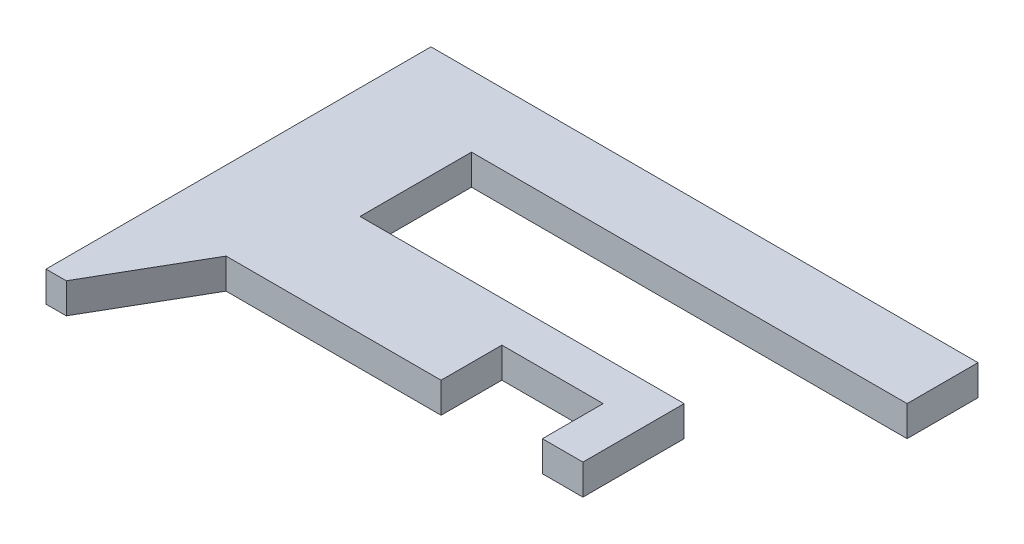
from build123d import *

# Parameters (mm, degrees)
EXTRUDE1_DEPTH = 3


with BuildPart() as part:
    # Sketch1 → Extrude1 (new body)
    with BuildSketch(Plane(origin=(0, 0, 0), x_dir=(1, 0, 0), z_dir=(0, 1, 0))):
        Polygon((0, 0), (2, 0), (7.773502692, 10), (29, 10), (29, 16), (39, 16), (39, 10), (43, 10), (43, 20), (11, 20), (11, 31), (54, 31), (54, 38), (0, 38), align=None)
    extrude(amount=EXTRUDE1_DEPTH)


solid = part.part
